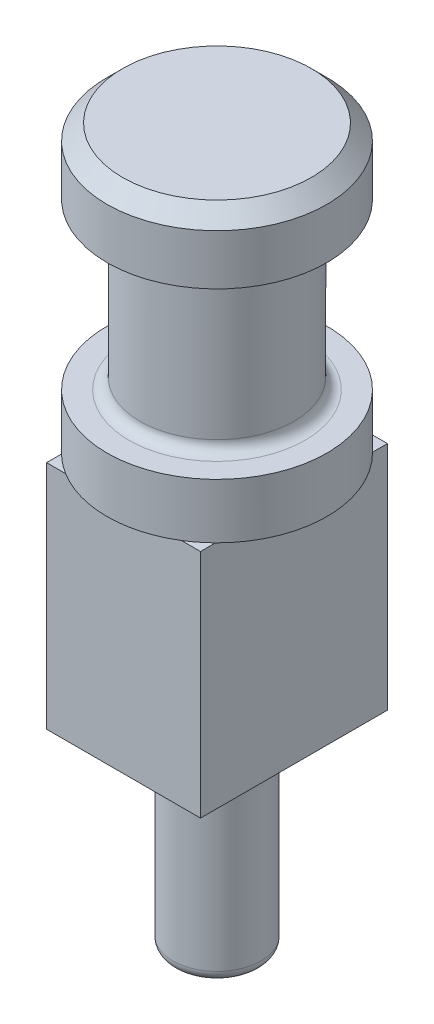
from build123d import *

# Parameters (mm, degrees)
FILLET1_R           = 1
FILLET2_R           = 1
SKETCH2_W           = 14
SKETCH2_H           = 21
BOSS_EXTRUDE1_DEPTH = 17


with BuildPart() as part:
    # Sketch1 → Revolve1 (revolve)
    with BuildSketch(Plane.XY, mode=Mode.PRIVATE) as revolve1_sk:
        Polygon((0, 45.954584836), (8.585786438, 45.954584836), (10, 44.540371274), (10, 39.954584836), (7, 39.954584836), (7, 24.954584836), (10, 24.954584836), (10, 19.954584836), (7, 19.954584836), (7, -1.045415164), (4, -1.045415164), (4, -19.045415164), (0, -19.045415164), align=None)
    revolve(revolve1_sk.sketch.rotate(Axis((0, 45.954584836, 0), (0, -1, 0)), 90), axis=Axis((0, 45.954584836, 0), (0, -1, 0)))

    # Fillet1
    fillet1_edges = [part.edges().sort_by_distance(p)[0] for p in [
        (0, -19.045415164, -4),
    ]]
    fillet(fillet1_edges, radius=FILLET1_R)

    # Fillet2
    fillet2_edges = [part.edges().sort_by_distance(p)[0] for p in [
        (0, 24.954584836, -7),
        (0, 39.954584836, -7),
    ]]
    fillet(fillet2_edges, radius=FILLET2_R)

    # Sketch2 → Boss-Extrude1 (add)
    with BuildSketch(Plane.XY.offset(8.5)):
        with Locations((0, 9.454584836)):
            Rectangle(SKETCH2_W, SKETCH2_H)
    extrude(amount=-BOSS_EXTRUDE1_DEPTH)


solid = part.part
